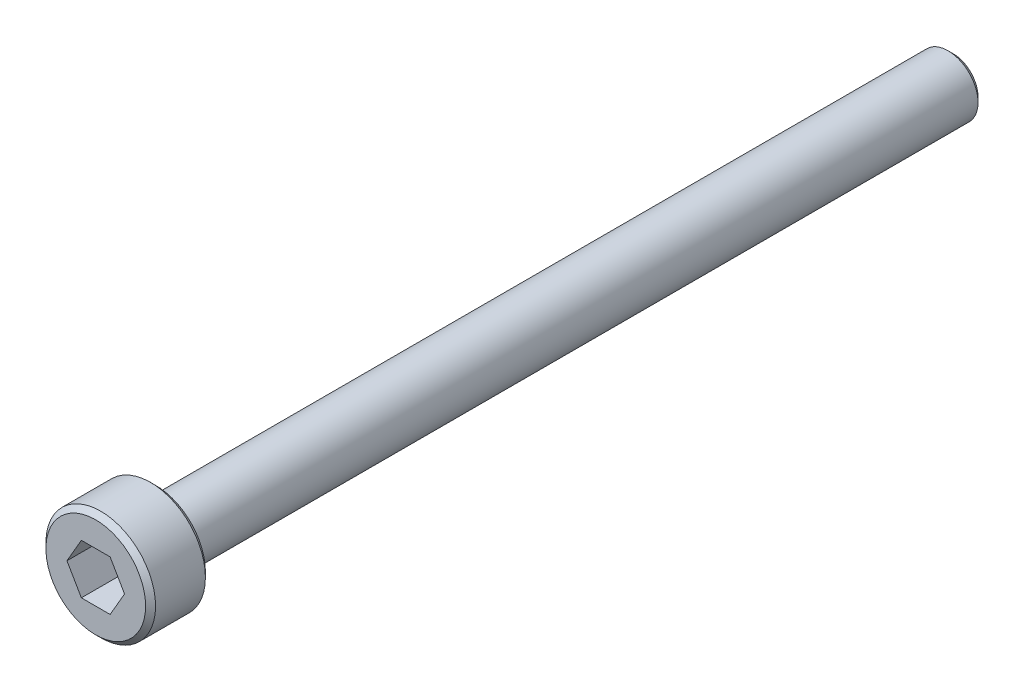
ISO-10303-21;
HEADER;
FILE_DESCRIPTION(('STEP AP214'),'2;1');
FILE_NAME('part.step','',(''),(''),'','','');
FILE_SCHEMA(('AUTOMOTIVE_DESIGN { 1 0 10303 214 1 1 1 1 }'));
ENDSEC;
DATA;
#1=APPLICATION_CONTEXT('core data for automotive mechanical design processes');
#2=APPLICATION_PROTOCOL_DEFINITION('international standard','automotive_design',2000,#1);
#3=PRODUCT_CONTEXT('',#1,'mechanical');
#4=PRODUCT('Part','Part','',(#3));
#5=PRODUCT_RELATED_PRODUCT_CATEGORY('part','',(#4));
#6=PRODUCT_DEFINITION_FORMATION('','',#4);
#7=PRODUCT_DEFINITION_CONTEXT('part definition',#1,'design');
#8=PRODUCT_DEFINITION('design','',#6,#7);
#9=PRODUCT_DEFINITION_SHAPE('','',#8);
#10=(LENGTH_UNIT() NAMED_UNIT(*) SI_UNIT(.MILLI.,.METRE.));
#11=(NAMED_UNIT(*) PLANE_ANGLE_UNIT() SI_UNIT($,.RADIAN.));
#12=(NAMED_UNIT(*) SI_UNIT($,.STERADIAN.) SOLID_ANGLE_UNIT());
#13=UNCERTAINTY_MEASURE_WITH_UNIT(LENGTH_MEASURE(1.E-05),#10,'distance_accuracy_value','');
#14=(GEOMETRIC_REPRESENTATION_CONTEXT(3) GLOBAL_UNCERTAINTY_ASSIGNED_CONTEXT((#13)) GLOBAL_UNIT_ASSIGNED_CONTEXT((#10,
#11,#12)) REPRESENTATION_CONTEXT('',''));
#15=CARTESIAN_POINT('',(0.,0.,0.));
#16=DIRECTION('',(0.,0.,1.));
#17=DIRECTION('',(1.,0.,0.));
#18=AXIS2_PLACEMENT_3D('',#15,#16,#17);
#19=CARTESIAN_POINT('',(0.,0.,40.));
#20=DIRECTION('',(0.,0.,-1.));
#21=DIRECTION('',(-1.,0.,0.));
#22=AXIS2_PLACEMENT_3D('',#19,#20,#21);
#23=CYLINDRICAL_SURFACE('',#22,1.5);
#24=CARTESIAN_POINT('',(0.,0.,0.250000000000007));
#25=DIRECTION('',(0.,0.,1.));
#26=DIRECTION('',(1.,0.,0.));
#27=AXIS2_PLACEMENT_3D('',#24,#25,#26);
#28=CIRCLE('',#27,1.5);
#29=CARTESIAN_POINT('',(1.5,0.,0.250000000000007));
#30=VERTEX_POINT('',#29);
#31=EDGE_CURVE('E187',#30,#30,#28,.T.);
#32=ORIENTED_EDGE('',*,*,#31,.T.);
#33=EDGE_LOOP('',(#32));
#34=FACE_BOUND('',#33,.T.);
#35=CARTESIAN_POINT('',(0.,0.,40.));
#36=DIRECTION('',(0.,0.,1.));
#37=DIRECTION('',(1.,0.,0.));
#38=AXIS2_PLACEMENT_3D('',#35,#36,#37);
#39=CIRCLE('',#38,1.5);
#40=CARTESIAN_POINT('',(1.5,0.,40.));
#41=VERTEX_POINT('',#40);
#42=EDGE_CURVE('E162',#41,#41,#39,.T.);
#43=ORIENTED_EDGE('',*,*,#42,.F.);
#44=EDGE_LOOP('',(#43));
#45=FACE_BOUND('',#44,.T.);
#46=ADVANCED_FACE('F50',(#34,#45),#23,.T.);
#47=CARTESIAN_POINT('',(0.,0.,0.));
#48=DIRECTION('',(0.,0.,1.));
#49=DIRECTION('',(1.,0.,0.));
#50=AXIS2_PLACEMENT_3D('',#47,#48,#49);
#51=PLANE('',#50);
#52=CARTESIAN_POINT('',(0.,0.,0.));
#53=DIRECTION('',(0.,0.,1.));
#54=DIRECTION('',(1.,0.,0.));
#55=AXIS2_PLACEMENT_3D('',#52,#53,#54);
#56=CIRCLE('',#55,1.24999999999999);
#57=CARTESIAN_POINT('',(1.24999999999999,0.,0.));
#58=VERTEX_POINT('',#57);
#59=EDGE_CURVE('E60',#58,#58,#56,.F.);
#60=ORIENTED_EDGE('',*,*,#59,.T.);
#61=EDGE_LOOP('',(#60));
#62=FACE_BOUND('',#61,.T.);
#63=ADVANCED_FACE('F193',(#62),#51,.F.);
#64=CARTESIAN_POINT('',(0.,0.,43.));
#65=DIRECTION('',(0.,0.,-1.));
#66=DIRECTION('',(-1.,0.,0.));
#67=AXIS2_PLACEMENT_3D('',#64,#65,#66);
#68=CYLINDRICAL_SURFACE('',#67,2.75);
#69=CARTESIAN_POINT('',(0.,0.,40.25));
#70=DIRECTION('',(0.,0.,1.));
#71=DIRECTION('',(1.,0.,0.));
#72=AXIS2_PLACEMENT_3D('',#69,#70,#71);
#73=CIRCLE('',#72,2.75);
#74=CARTESIAN_POINT('',(2.75,0.,40.25));
#75=VERTEX_POINT('',#74);
#76=EDGE_CURVE('E178',#75,#75,#73,.T.);
#77=ORIENTED_EDGE('',*,*,#76,.T.);
#78=EDGE_LOOP('',(#77));
#79=FACE_BOUND('',#78,.T.);
#80=CARTESIAN_POINT('',(0.,0.,42.75));
#81=DIRECTION('',(0.,0.,1.));
#82=DIRECTION('',(1.,0.,0.));
#83=AXIS2_PLACEMENT_3D('',#80,#81,#82);
#84=CIRCLE('',#83,2.75);
#85=CARTESIAN_POINT('',(2.75,0.,42.75));
#86=VERTEX_POINT('',#85);
#87=EDGE_CURVE('E177',#86,#86,#84,.F.);
#88=ORIENTED_EDGE('',*,*,#87,.T.);
#89=EDGE_LOOP('',(#88));
#90=FACE_BOUND('',#89,.T.);
#91=ADVANCED_FACE('F219',(#79,#90),#68,.T.);
#92=CARTESIAN_POINT('',(0.,0.,43.));
#93=DIRECTION('',(0.,0.,1.));
#94=DIRECTION('',(1.,0.,0.));
#95=AXIS2_PLACEMENT_3D('',#92,#93,#94);
#96=PLANE('',#95);
#97=DIRECTION('',(0.5,0.866025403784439,0.));
#98=VECTOR('',#97,1.);
#99=CARTESIAN_POINT('',(0.721687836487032,-1.25,43.));
#100=LINE('',#99,#98);
#101=CARTESIAN_POINT('',(0.721687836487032,-1.25,43.));
#102=VERTEX_POINT('',#101);
#103=CARTESIAN_POINT('',(1.44337567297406,0.,43.));
#104=VERTEX_POINT('',#103);
#105=EDGE_CURVE('E65',#102,#104,#100,.T.);
#106=ORIENTED_EDGE('',*,*,#105,.F.);
#107=DIRECTION('',(1.,0.,0.));
#108=VECTOR('',#107,1.);
#109=CARTESIAN_POINT('',(-0.721687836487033,-1.25,43.));
#110=LINE('',#109,#108);
#111=CARTESIAN_POINT('',(-0.721687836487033,-1.25,43.));
#112=VERTEX_POINT('',#111);
#113=EDGE_CURVE('E160',#112,#102,#110,.T.);
#114=ORIENTED_EDGE('',*,*,#113,.F.);
#115=DIRECTION('',(0.5,-0.866025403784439,0.));
#116=VECTOR('',#115,1.);
#117=CARTESIAN_POINT('',(-1.44337567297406,0.,43.));
#118=LINE('',#117,#116);
#119=CARTESIAN_POINT('',(-1.44337567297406,0.,43.));
#120=VERTEX_POINT('',#119);
#121=EDGE_CURVE('E152',#120,#112,#118,.T.);
#122=ORIENTED_EDGE('',*,*,#121,.F.);
#123=DIRECTION('',(-0.5,-0.866025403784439,0.));
#124=VECTOR('',#123,1.);
#125=CARTESIAN_POINT('',(-0.721687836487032,1.25,43.));
#126=LINE('',#125,#124);
#127=CARTESIAN_POINT('',(-0.721687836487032,1.25,43.));
#128=VERTEX_POINT('',#127);
#129=EDGE_CURVE('E115',#128,#120,#126,.T.);
#130=ORIENTED_EDGE('',*,*,#129,.F.);
#131=DIRECTION('',(-1.,0.,0.));
#132=VECTOR('',#131,1.);
#133=CARTESIAN_POINT('',(0.721687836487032,1.25,43.));
#134=LINE('',#133,#132);
#135=CARTESIAN_POINT('',(0.721687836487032,1.25,43.));
#136=VERTEX_POINT('',#135);
#137=EDGE_CURVE('E146',#136,#128,#134,.T.);
#138=ORIENTED_EDGE('',*,*,#137,.F.);
#139=DIRECTION('',(-0.5,0.866025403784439,0.));
#140=VECTOR('',#139,1.);
#141=CARTESIAN_POINT('',(1.44337567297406,0.,43.));
#142=LINE('',#141,#140);
#143=EDGE_CURVE('E145',#104,#136,#142,.T.);
#144=ORIENTED_EDGE('',*,*,#143,.F.);
#145=EDGE_LOOP('',(#106,#114,#122,#130,#138,#144));
#146=FACE_BOUND('',#145,.T.);
#147=CARTESIAN_POINT('',(0.,0.,43.));
#148=DIRECTION('',(0.,0.,1.));
#149=DIRECTION('',(1.,0.,0.));
#150=AXIS2_PLACEMENT_3D('',#147,#148,#149);
#151=CIRCLE('',#150,2.50000000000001);
#152=CARTESIAN_POINT('',(2.50000000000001,0.,43.));
#153=VERTEX_POINT('',#152);
#154=EDGE_CURVE('E11',#153,#153,#151,.T.);
#155=ORIENTED_EDGE('',*,*,#154,.T.);
#156=EDGE_LOOP('',(#155));
#157=FACE_BOUND('',#156,.T.);
#158=ADVANCED_FACE('F209',(#146,#157),#96,.T.);
#159=CARTESIAN_POINT('',(0.,0.,40.));
#160=DIRECTION('',(0.,0.,1.));
#161=DIRECTION('',(1.,0.,0.));
#162=AXIS2_PLACEMENT_3D('',#159,#160,#161);
#163=PLANE('',#162);
#164=CARTESIAN_POINT('',(0.,0.,40.));
#165=DIRECTION('',(0.,0.,1.));
#166=DIRECTION('',(1.,0.,0.));
#167=AXIS2_PLACEMENT_3D('',#164,#165,#166);
#168=CIRCLE('',#167,2.5);
#169=CARTESIAN_POINT('',(2.5,0.,40.));
#170=VERTEX_POINT('',#169);
#171=EDGE_CURVE('E184',#170,#170,#168,.F.);
#172=ORIENTED_EDGE('',*,*,#171,.T.);
#173=EDGE_LOOP('',(#172));
#174=FACE_BOUND('',#173,.T.);
#175=ORIENTED_EDGE('',*,*,#42,.T.);
#176=EDGE_LOOP('',(#175));
#177=FACE_BOUND('',#176,.T.);
#178=ADVANCED_FACE('F208',(#174,#177),#163,.F.);
#179=CARTESIAN_POINT('',(0.,0.,40.25));
#180=DIRECTION('',(0.,0.,1.));
#181=DIRECTION('',(1.,0.,0.));
#182=AXIS2_PLACEMENT_3D('',#179,#180,#181);
#183=CONICAL_SURFACE('',#182,2.75,0.78539816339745);
#184=ORIENTED_EDGE('',*,*,#171,.F.);
#185=EDGE_LOOP('',(#184));
#186=FACE_BOUND('',#185,.T.);
#187=ORIENTED_EDGE('',*,*,#76,.F.);
#188=EDGE_LOOP('',(#187));
#189=FACE_BOUND('',#188,.T.);
#190=ADVANCED_FACE('F199',(#186,#189),#183,.T.);
#191=CARTESIAN_POINT('',(0.,0.,0.250000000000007));
#192=DIRECTION('',(0.,0.,1.));
#193=DIRECTION('',(1.,0.,0.));
#194=AXIS2_PLACEMENT_3D('',#191,#192,#193);
#195=CONICAL_SURFACE('',#194,1.5,0.785398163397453);
#196=ORIENTED_EDGE('',*,*,#59,.F.);
#197=EDGE_LOOP('',(#196));
#198=FACE_BOUND('',#197,.T.);
#199=ORIENTED_EDGE('',*,*,#31,.F.);
#200=EDGE_LOOP('',(#199));
#201=FACE_BOUND('',#200,.T.);
#202=ADVANCED_FACE('F197',(#198,#201),#195,.T.);
#203=CARTESIAN_POINT('',(0.,0.,43.));
#204=DIRECTION('',(0.,0.,-1.));
#205=DIRECTION('',(-1.,0.,0.));
#206=AXIS2_PLACEMENT_3D('',#203,#204,#205);
#207=CONICAL_SURFACE('',#206,2.50000000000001,0.785398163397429);
#208=ORIENTED_EDGE('',*,*,#87,.F.);
#209=EDGE_LOOP('',(#208));
#210=FACE_BOUND('',#209,.T.);
#211=ORIENTED_EDGE('',*,*,#154,.F.);
#212=EDGE_LOOP('',(#211));
#213=FACE_BOUND('',#212,.T.);
#214=ADVANCED_FACE('F49',(#210,#213),#207,.T.);
#215=CARTESIAN_POINT('',(0.721687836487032,-1.25,41.));
#216=DIRECTION('',(0.866025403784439,-0.5,0.));
#217=DIRECTION('',(0.5,0.866025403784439,0.));
#218=AXIS2_PLACEMENT_3D('',#215,#216,#217);
#219=PLANE('',#218);
#220=ORIENTED_EDGE('',*,*,#105,.T.);
#221=DIRECTION('',(0.,0.,1.));
#222=VECTOR('',#221,1.);
#223=CARTESIAN_POINT('',(1.44337567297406,0.,41.));
#224=LINE('',#223,#222);
#225=CARTESIAN_POINT('',(1.44337567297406,0.,41.));
#226=VERTEX_POINT('',#225);
#227=EDGE_CURVE('E94',#226,#104,#224,.T.);
#228=ORIENTED_EDGE('',*,*,#227,.F.);
#229=DIRECTION('',(0.5,0.866025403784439,0.));
#230=VECTOR('',#229,1.);
#231=CARTESIAN_POINT('',(0.721687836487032,-1.25,41.));
#232=LINE('',#231,#230);
#233=CARTESIAN_POINT('',(0.721687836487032,-1.25,41.));
#234=VERTEX_POINT('',#233);
#235=EDGE_CURVE('E159',#234,#226,#232,.T.);
#236=ORIENTED_EDGE('',*,*,#235,.F.);
#237=DIRECTION('',(0.,0.,1.));
#238=VECTOR('',#237,1.);
#239=CARTESIAN_POINT('',(0.721687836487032,-1.25,41.));
#240=LINE('',#239,#238);
#241=EDGE_CURVE('E75',#234,#102,#240,.T.);
#242=ORIENTED_EDGE('',*,*,#241,.T.);
#243=EDGE_LOOP('',(#220,#228,#236,#242));
#244=FACE_BOUND('',#243,.T.);
#245=ADVANCED_FACE('F279',(#244),#219,.F.);
#246=CARTESIAN_POINT('',(-0.721687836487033,-1.25,41.));
#247=DIRECTION('',(0.,-1.,0.));
#248=DIRECTION('',(1.,0.,0.));
#249=AXIS2_PLACEMENT_3D('',#246,#247,#248);
#250=PLANE('',#249);
#251=ORIENTED_EDGE('',*,*,#113,.T.);
#252=ORIENTED_EDGE('',*,*,#241,.F.);
#253=DIRECTION('',(1.,0.,0.));
#254=VECTOR('',#253,1.);
#255=CARTESIAN_POINT('',(-0.721687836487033,-1.25,41.));
#256=LINE('',#255,#254);
#257=CARTESIAN_POINT('',(-0.721687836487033,-1.25,41.));
#258=VERTEX_POINT('',#257);
#259=EDGE_CURVE('E127',#258,#234,#256,.T.);
#260=ORIENTED_EDGE('',*,*,#259,.F.);
#261=DIRECTION('',(0.,0.,1.));
#262=VECTOR('',#261,1.);
#263=CARTESIAN_POINT('',(-0.721687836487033,-1.25,41.));
#264=LINE('',#263,#262);
#265=EDGE_CURVE('E119',#258,#112,#264,.T.);
#266=ORIENTED_EDGE('',*,*,#265,.T.);
#267=EDGE_LOOP('',(#251,#252,#260,#266));
#268=FACE_BOUND('',#267,.T.);
#269=ADVANCED_FACE('F287',(#268),#250,.F.);
#270=CARTESIAN_POINT('',(-1.44337567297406,0.,41.));
#271=DIRECTION('',(-0.866025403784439,-0.5,0.));
#272=DIRECTION('',(0.5,-0.866025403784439,0.));
#273=AXIS2_PLACEMENT_3D('',#270,#271,#272);
#274=PLANE('',#273);
#275=ORIENTED_EDGE('',*,*,#121,.T.);
#276=ORIENTED_EDGE('',*,*,#265,.F.);
#277=DIRECTION('',(0.5,-0.866025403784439,0.));
#278=VECTOR('',#277,1.);
#279=CARTESIAN_POINT('',(-1.44337567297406,0.,41.));
#280=LINE('',#279,#278);
#281=CARTESIAN_POINT('',(-1.44337567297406,0.,41.));
#282=VERTEX_POINT('',#281);
#283=EDGE_CURVE('E122',#282,#258,#280,.T.);
#284=ORIENTED_EDGE('',*,*,#283,.F.);
#285=DIRECTION('',(0.,0.,1.));
#286=VECTOR('',#285,1.);
#287=CARTESIAN_POINT('',(-1.44337567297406,0.,41.));
#288=LINE('',#287,#286);
#289=EDGE_CURVE('E104',#282,#120,#288,.T.);
#290=ORIENTED_EDGE('',*,*,#289,.T.);
#291=EDGE_LOOP('',(#275,#276,#284,#290));
#292=FACE_BOUND('',#291,.T.);
#293=ADVANCED_FACE('F125',(#292),#274,.F.);
#294=CARTESIAN_POINT('',(-0.721687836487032,1.25,41.));
#295=DIRECTION('',(-0.866025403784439,0.5,0.));
#296=DIRECTION('',(-0.5,-0.866025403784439,0.));
#297=AXIS2_PLACEMENT_3D('',#294,#295,#296);
#298=PLANE('',#297);
#299=ORIENTED_EDGE('',*,*,#129,.T.);
#300=ORIENTED_EDGE('',*,*,#289,.F.);
#301=DIRECTION('',(-0.5,-0.866025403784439,0.));
#302=VECTOR('',#301,1.);
#303=CARTESIAN_POINT('',(-0.721687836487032,1.25,41.));
#304=LINE('',#303,#302);
#305=CARTESIAN_POINT('',(-0.721687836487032,1.25,41.));
#306=VERTEX_POINT('',#305);
#307=EDGE_CURVE('E108',#306,#282,#304,.T.);
#308=ORIENTED_EDGE('',*,*,#307,.F.);
#309=DIRECTION('',(0.,0.,1.));
#310=VECTOR('',#309,1.);
#311=CARTESIAN_POINT('',(-0.721687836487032,1.25,41.));
#312=LINE('',#311,#310);
#313=EDGE_CURVE('E117',#306,#128,#312,.T.);
#314=ORIENTED_EDGE('',*,*,#313,.T.);
#315=EDGE_LOOP('',(#299,#300,#308,#314));
#316=FACE_BOUND('',#315,.T.);
#317=ADVANCED_FACE('F110',(#316),#298,.F.);
#318=CARTESIAN_POINT('',(0.721687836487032,1.25,41.));
#319=DIRECTION('',(0.,1.,0.));
#320=DIRECTION('',(-1.,0.,0.));
#321=AXIS2_PLACEMENT_3D('',#318,#319,#320);
#322=PLANE('',#321);
#323=ORIENTED_EDGE('',*,*,#137,.T.);
#324=ORIENTED_EDGE('',*,*,#313,.F.);
#325=DIRECTION('',(-1.,0.,0.));
#326=VECTOR('',#325,1.);
#327=CARTESIAN_POINT('',(0.721687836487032,1.25,41.));
#328=LINE('',#327,#326);
#329=CARTESIAN_POINT('',(0.721687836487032,1.25,41.));
#330=VERTEX_POINT('',#329);
#331=EDGE_CURVE('E134',#330,#306,#328,.T.);
#332=ORIENTED_EDGE('',*,*,#331,.F.);
#333=DIRECTION('',(0.,0.,1.));
#334=VECTOR('',#333,1.);
#335=CARTESIAN_POINT('',(0.721687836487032,1.25,41.));
#336=LINE('',#335,#334);
#337=EDGE_CURVE('E169',#330,#136,#336,.T.);
#338=ORIENTED_EDGE('',*,*,#337,.T.);
#339=EDGE_LOOP('',(#323,#324,#332,#338));
#340=FACE_BOUND('',#339,.T.);
#341=ADVANCED_FACE('F309',(#340),#322,.F.);
#342=CARTESIAN_POINT('',(1.44337567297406,0.,41.));
#343=DIRECTION('',(0.866025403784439,0.5,0.));
#344=DIRECTION('',(-0.5,0.866025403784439,0.));
#345=AXIS2_PLACEMENT_3D('',#342,#343,#344);
#346=PLANE('',#345);
#347=ORIENTED_EDGE('',*,*,#143,.T.);
#348=ORIENTED_EDGE('',*,*,#337,.F.);
#349=DIRECTION('',(-0.5,0.866025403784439,0.));
#350=VECTOR('',#349,1.);
#351=CARTESIAN_POINT('',(1.44337567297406,0.,41.));
#352=LINE('',#351,#350);
#353=EDGE_CURVE('E137',#226,#330,#352,.T.);
#354=ORIENTED_EDGE('',*,*,#353,.F.);
#355=ORIENTED_EDGE('',*,*,#227,.T.);
#356=EDGE_LOOP('',(#347,#348,#354,#355));
#357=FACE_BOUND('',#356,.T.);
#358=ADVANCED_FACE('F317',(#357),#346,.F.);
#359=CARTESIAN_POINT('',(0.,0.,41.));
#360=DIRECTION('',(0.,0.,1.));
#361=DIRECTION('',(1.,0.,0.));
#362=AXIS2_PLACEMENT_3D('',#359,#360,#361);
#363=PLANE('',#362);
#364=ORIENTED_EDGE('',*,*,#235,.T.);
#365=ORIENTED_EDGE('',*,*,#353,.T.);
#366=ORIENTED_EDGE('',*,*,#331,.T.);
#367=ORIENTED_EDGE('',*,*,#307,.T.);
#368=ORIENTED_EDGE('',*,*,#283,.T.);
#369=ORIENTED_EDGE('',*,*,#259,.T.);
#370=EDGE_LOOP('',(#364,#365,#366,#367,#368,#369));
#371=FACE_BOUND('',#370,.T.);
#372=ADVANCED_FACE('F129',(#371),#363,.T.);
#373=CLOSED_SHELL('',(#46,#63,#91,#158,#178,#190,#202,#214,#245,#269,#293,#317,#341,#358,#372));
#374=MANIFOLD_SOLID_BREP('B2',#373);
#375=ADVANCED_BREP_SHAPE_REPRESENTATION('',(#18,#374),#14);
#376=SHAPE_DEFINITION_REPRESENTATION(#9,#375);
ENDSEC;
END-ISO-10303-21;
